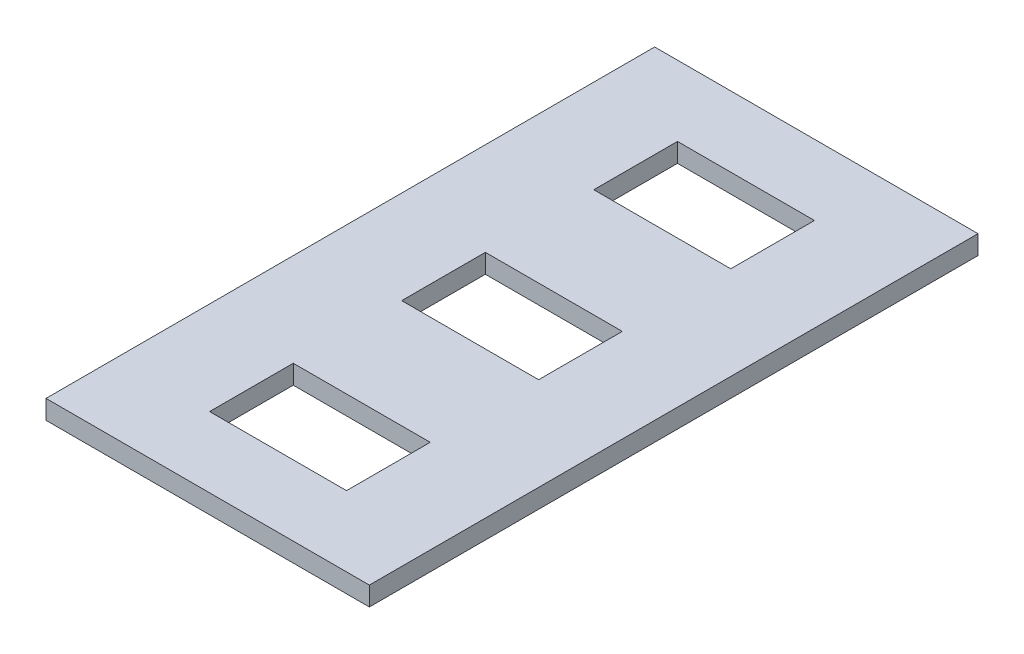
from build123d import *

# Parameters (mm, degrees)
SKETCH_1_W      = 85
SKETCH_1_H      = 160
SKETCH_1_W_2    = 36
SKETCH_1_H_2    = 22
EXTRUDE_1_DEPTH = 5


with BuildPart() as part:
    # Sketch 1 → Extrude 1 (new body)
    with BuildSketch(Plane(origin=(0, 0, 0), x_dir=(1, 0, 0), z_dir=(0, 1, 0))):
        Rectangle(SKETCH_1_W, SKETCH_1_H)
        Rectangle(SKETCH_1_W_2, SKETCH_1_H_2, mode=Mode.SUBTRACT)
        with Locations((0, 50.5)):
            Rectangle(SKETCH_1_W_2, SKETCH_1_H_2, mode=Mode.SUBTRACT)
        with Locations((0, -50.5)):
            Rectangle(SKETCH_1_W_2, SKETCH_1_H_2, mode=Mode.SUBTRACT)
    extrude(amount=EXTRUDE_1_DEPTH)


solid = part.part
